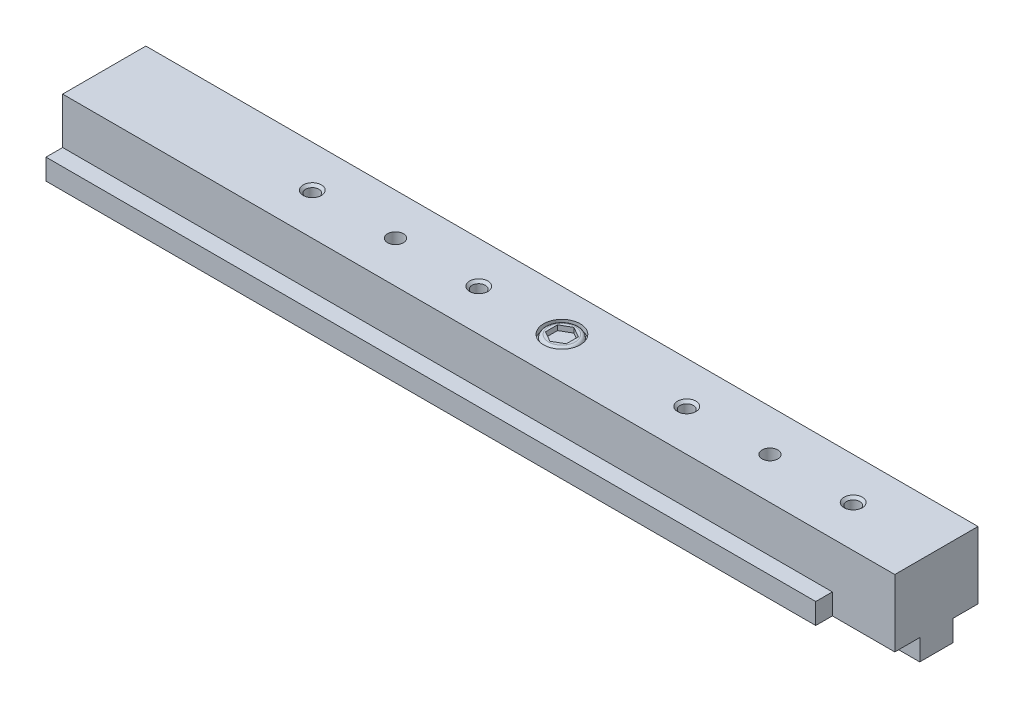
from build123d import *

# Parameters (mm, degrees)
EXTRUDE1_DEPTH     = 117.475
EXTRUDE2_DEPTH     = 9.525
SKETCH7_R          = 1.20269
CUT_EXTRUDE1_DEPTH = 3.048
SKETCH8_R          = 1.20269
CUT_EXTRUDE2_DEPTH = 3.048
SKETCH9_R          = 2.794
CUT_EXTRUDE3_DEPTH = 0.762
CUT_EXTRUDE4_DEPTH = 0.762


with BuildPart() as part:
    # Sketch1 → Extrude1 (new body)
    with BuildSketch(Plane(origin=(0, 0, 0), x_dir=(0, 0, -1), z_dir=(1, 0, 0))):
        Polygon((-8.89, 3.2258), (-2.54, 3.2258), (-2.54, 0), (2.54, 0), (2.54, 3.2258), (8.89, 3.2258), (8.89, 6.4008), (6.35, 6.4008), (6.35, 13.462), (-6.35, 13.462), (-6.35, 6.4008), (-8.89, 6.4008), align=None)
    extrude(amount=EXTRUDE1_DEPTH)

    # Sketch2 → Extrude2 (add)
    with BuildSketch(Plane(origin=(117.475, 0, 0), x_dir=(0, 0, -1), z_dir=(1, 0, 0))):
        Polygon((-6.35, 3.2258), (-2.54, 3.2258), (-2.54, 0), (2.54, 0), (2.54, 3.2258), (6.35, 3.2258), (6.35, 13.462), (-6.35, 13.462), align=None)
    extrude(amount=EXTRUDE2_DEPTH)

    # Sketch3 → Cut-Revolve1 (revolve, cut)
    with BuildSketch(Plane(origin=(114.3, 0, 0), x_dir=(0, 0, -1), z_dir=(1, 0, 0)), mode=Mode.PRIVATE) as cut_revolve1_sk:
        Polygon((0, 13.462), (1.397, 13.462), (1.016, 13.081), (1.016, 5.793587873), (0, 5.207), align=None)
    revolve(cut_revolve1_sk.sketch.rotate(Axis((114.3, 5.207, 0), (0, 1, 0)), 180), axis=Axis((114.3, 5.207, 0), (0, 1, 0)), mode=Mode.SUBTRACT)

    # Sketch4 → Cut-Revolve2 (revolve, cut)
    with BuildSketch(Plane(origin=(31.75, 0, 0), x_dir=(0, 0, -1), z_dir=(1, 0, 0)), mode=Mode.PRIVATE) as cut_revolve2_sk:
        Polygon((0, 13.462), (1.397, 13.462), (1.016, 13.081), (1.016, 7.698587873), (0, 7.112), align=None)
    revolve(cut_revolve2_sk.sketch.rotate(Axis((31.75, 7.112, 0), (0, 1, 0)), 180), axis=Axis((31.75, 7.112, 0), (0, 1, 0)), mode=Mode.SUBTRACT)

    # Sketch5 → Cut-Revolve3 (revolve, cut)
    with BuildSketch(Plane(origin=(88.9, 0, 0), x_dir=(0, 0, -1), z_dir=(1, 0, 0)), mode=Mode.PRIVATE) as cut_revolve3_sk:
        Polygon((0, 13.462), (1.397, 13.462), (1.016, 13.081), (1.016, 5.793587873), (0, 5.207), align=None)
    revolve(cut_revolve3_sk.sketch.rotate(Axis((88.9, 5.207, 0), (0, 1, 0)), 180), axis=Axis((88.9, 5.207, 0), (0, 1, 0)), mode=Mode.SUBTRACT)

    # Sketch6 → Cut-Revolve4 (revolve, cut)
    with BuildSketch(Plane(origin=(57.15, 0, 0), x_dir=(0, 0, -1), z_dir=(1, 0, 0)), mode=Mode.PRIVATE) as cut_revolve4_sk:
        Polygon((0, 13.462), (1.397, 13.462), (1.016, 13.081), (1.016, 5.793587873), (0, 5.207), align=None)
    revolve(cut_revolve4_sk.sketch.rotate(Axis((57.15, 5.207, 0), (0, 1, 0)), 180), axis=Axis((57.15, 5.207, 0), (0, 1, 0)), mode=Mode.SUBTRACT)

    # Sketch7 → Cut-Extrude1 (cut)
    with BuildSketch(Plane(origin=(0, 13.462, 0), x_dir=(-1, 0, 0), z_dir=(0, 1, 0))):
        with Locations(Location((-101.6, 0, 0), (0, 0, 90))):
            Circle(SKETCH7_R)
    extrude(amount=-CUT_EXTRUDE1_DEPTH, mode=Mode.SUBTRACT)

    # Sketch8 → Cut-Extrude2 (cut)
    with BuildSketch(Plane(origin=(0, 13.462, 0), x_dir=(-1, 0, 0), z_dir=(0, 1, 0))):
        with Locations(Location((-44.45, 0, 0), (0, 0, 90))):
            Circle(SKETCH8_R)
    extrude(amount=-CUT_EXTRUDE2_DEPTH, mode=Mode.SUBTRACT)

    # Sketch9 → Cut-Extrude3 (cut)
    with BuildSketch(Plane(origin=(0, 13.462, 0), x_dir=(-1, 0, 0), z_dir=(0, 1, 0))):
        with Locations(Location((-69.85, 0, 0), (0, 0, 90))):
            Circle(SKETCH9_R)
    extrude(amount=-CUT_EXTRUDE3_DEPTH, mode=Mode.SUBTRACT)

    # Sketch10 → Revolve1 (revolve)
    with BuildSketch(Plane(origin=(69.85, 0, 0), x_dir=(0, 0, -1), z_dir=(1, 0, 0)), mode=Mode.PRIVATE) as revolve1_sk:
        with BuildLine():
            Line((0, 13.462), (2.032, 13.462))
            ThreePointArc((2.032, 13.462), (2.391210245, 13.313210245), (2.54, 12.954))
            Line((2.54, 12.954), (2.54, 11.938))
            Line((2.54, 11.938), (0, 11.938))
            Line((0, 11.938), (0, 13.462))
        make_face()
    revolve(revolve1_sk.sketch.rotate(Axis((69.85, 11.938, 0), (0, 1, 0)), 180), axis=Axis((69.85, 11.938, 0), (0, 1, 0)))

    # Sketch11 → Cut-Extrude4 (cut)
    with BuildSketch(Plane(origin=(0, 13.462, 0), x_dir=(-1, 0, 0), z_dir=(0, 1, 0))):
        Polygon((-68.2625, -0.916543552), (-68.2625, 0.916543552), (-69.85, 1.833087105), (-71.4375, 0.916543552), (-71.4375, -0.916543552), (-69.85, -1.833087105), align=None)
    extrude(amount=-CUT_EXTRUDE4_DEPTH, mode=Mode.SUBTRACT)


solid = part.part
